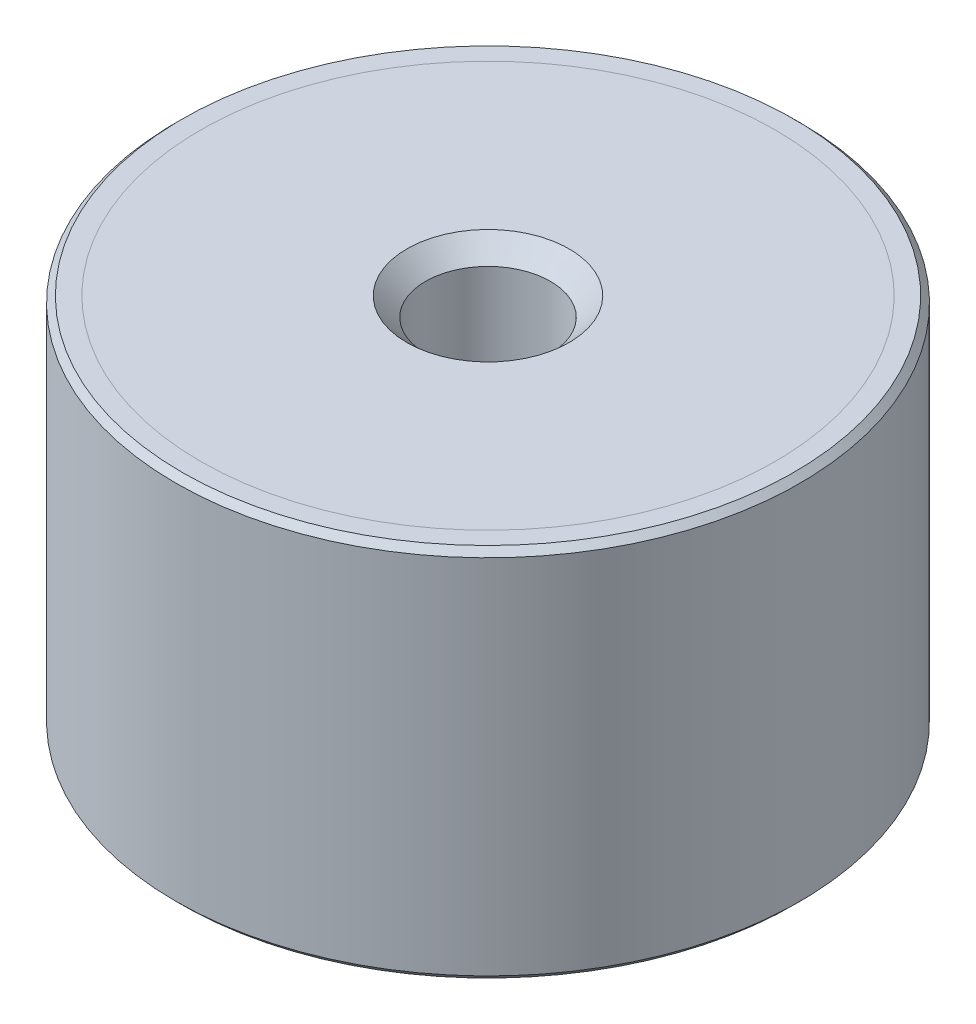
ISO-10303-21;
HEADER;
FILE_DESCRIPTION(('STEP AP214'),'2;1');
FILE_NAME('part.step','',(''),(''),'','','');
FILE_SCHEMA(('AUTOMOTIVE_DESIGN { 1 0 10303 214 1 1 1 1 }'));
ENDSEC;
DATA;
#1=APPLICATION_CONTEXT('core data for automotive mechanical design processes');
#2=APPLICATION_PROTOCOL_DEFINITION('international standard','automotive_design',2000,#1);
#3=PRODUCT_CONTEXT('',#1,'mechanical');
#4=PRODUCT('Part','Part','',(#3));
#5=PRODUCT_RELATED_PRODUCT_CATEGORY('part','',(#4));
#6=PRODUCT_DEFINITION_FORMATION('','',#4);
#7=PRODUCT_DEFINITION_CONTEXT('part definition',#1,'design');
#8=PRODUCT_DEFINITION('design','',#6,#7);
#9=PRODUCT_DEFINITION_SHAPE('','',#8);
#10=(LENGTH_UNIT() NAMED_UNIT(*) SI_UNIT(.MILLI.,.METRE.));
#11=(NAMED_UNIT(*) PLANE_ANGLE_UNIT() SI_UNIT($,.RADIAN.));
#12=(NAMED_UNIT(*) SI_UNIT($,.STERADIAN.) SOLID_ANGLE_UNIT());
#13=UNCERTAINTY_MEASURE_WITH_UNIT(LENGTH_MEASURE(1.E-05),#10,'distance_accuracy_value','');
#14=(GEOMETRIC_REPRESENTATION_CONTEXT(3) GLOBAL_UNCERTAINTY_ASSIGNED_CONTEXT((#13)) GLOBAL_UNIT_ASSIGNED_CONTEXT((#10,
#11,#12)) REPRESENTATION_CONTEXT('',''));
#15=CARTESIAN_POINT('',(0.,0.,0.));
#16=DIRECTION('',(0.,0.,1.));
#17=DIRECTION('',(1.,0.,0.));
#18=AXIS2_PLACEMENT_3D('',#15,#16,#17);
#19=CARTESIAN_POINT('',(0.,-27.,5.));
#20=DIRECTION('',(0.,1.,0.));
#21=DIRECTION('',(0.,0.,1.));
#22=AXIS2_PLACEMENT_3D('',#19,#20,#21);
#23=PLANE('',#22);
#24=CARTESIAN_POINT('',(0.,-27.,0.));
#25=DIRECTION('',(0.,1.,0.));
#26=DIRECTION('',(0.,0.,1.));
#27=AXIS2_PLACEMENT_3D('',#24,#25,#26);
#28=CIRCLE('',#27,23.);
#29=CARTESIAN_POINT('',(0.,-27.,23.));
#30=VERTEX_POINT('',#29);
#31=EDGE_CURVE('P0_E25',#30,#30,#28,.T.);
#32=ORIENTED_EDGE('',*,*,#31,.T.);
#33=EDGE_LOOP('',(#32));
#34=FACE_BOUND('',#33,.T.);
#35=CARTESIAN_POINT('',(0.,-27.,0.));
#36=DIRECTION('',(0.,1.,0.));
#37=DIRECTION('',(0.,0.,1.));
#38=AXIS2_PLACEMENT_3D('',#35,#36,#37);
#39=CIRCLE('',#38,5.);
#40=CARTESIAN_POINT('',(0.,-27.,5.));
#41=VERTEX_POINT('',#40);
#42=EDGE_CURVE('P0_E21',#41,#41,#39,.T.);
#43=ORIENTED_EDGE('',*,*,#42,.F.);
#44=EDGE_LOOP('',(#43));
#45=FACE_BOUND('',#44,.T.);
#46=ADVANCED_FACE('P0_F14',(#34,#45),#23,.T.);
#47=CARTESIAN_POINT('',(0.,41.0340428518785,0.));
#48=DIRECTION('',(0.,1.,0.));
#49=DIRECTION('',(0.,0.,1.));
#50=AXIS2_PLACEMENT_3D('',#47,#48,#49);
#51=CYLINDRICAL_SURFACE('',#50,23.);
#52=CARTESIAN_POINT('',(0.,-28.5,0.));
#53=DIRECTION('',(0.,1.,0.));
#54=DIRECTION('',(0.,0.,1.));
#55=AXIS2_PLACEMENT_3D('',#52,#53,#54);
#56=CIRCLE('',#55,23.);
#57=CARTESIAN_POINT('',(0.,-28.5,23.));
#58=VERTEX_POINT('',#57);
#59=EDGE_CURVE('P0_E29',#58,#58,#56,.T.);
#60=ORIENTED_EDGE('',*,*,#59,.T.);
#61=EDGE_LOOP('',(#60));
#62=FACE_BOUND('',#61,.T.);
#63=ORIENTED_EDGE('',*,*,#31,.F.);
#64=EDGE_LOOP('',(#63));
#65=FACE_BOUND('',#64,.T.);
#66=ADVANCED_FACE('P0_F35',(#62,#65),#51,.T.);
#67=CARTESIAN_POINT('',(0.,-28.5,23.));
#68=DIRECTION('',(0.,-1.,0.));
#69=DIRECTION('',(0.,0.,-1.));
#70=AXIS2_PLACEMENT_3D('',#67,#68,#69);
#71=PLANE('',#70);
#72=CARTESIAN_POINT('',(0.,-28.5,0.));
#73=DIRECTION('',(0.,-1.,0.));
#74=DIRECTION('',(0.,0.,-1.));
#75=AXIS2_PLACEMENT_3D('',#72,#73,#74);
#76=CIRCLE('',#75,6.5);
#77=CARTESIAN_POINT('',(0.,-28.5,-6.5));
#78=VERTEX_POINT('',#77);
#79=EDGE_CURVE('P0_E10',#78,#78,#76,.F.);
#80=ORIENTED_EDGE('',*,*,#79,.T.);
#81=EDGE_LOOP('',(#80));
#82=FACE_BOUND('',#81,.T.);
#83=ORIENTED_EDGE('',*,*,#59,.F.);
#84=EDGE_LOOP('',(#83));
#85=FACE_BOUND('',#84,.T.);
#86=ADVANCED_FACE('P0_F38',(#82,#85),#71,.T.);
#87=CARTESIAN_POINT('',(0.,-28.5,0.));
#88=DIRECTION('',(0.,-1.,0.));
#89=DIRECTION('',(0.,0.,-1.));
#90=AXIS2_PLACEMENT_3D('',#87,#88,#89);
#91=CONICAL_SURFACE('',#90,6.5,0.785398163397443);
#92=ORIENTED_EDGE('',*,*,#42,.T.);
#93=EDGE_LOOP('',(#92));
#94=FACE_BOUND('',#93,.T.);
#95=ORIENTED_EDGE('',*,*,#79,.F.);
#96=EDGE_LOOP('',(#95));
#97=FACE_BOUND('',#96,.T.);
#98=ADVANCED_FACE('P0_F16',(#94,#97),#91,.F.);
#99=CLOSED_SHELL('',(#46,#66,#86,#98));
#100=MANIFOLD_SOLID_BREP('P0_B1',#99);
#101=CARTESIAN_POINT('',(0.,1.5,5.));
#102=DIRECTION('',(0.,1.,0.));
#103=DIRECTION('',(0.,0.,1.));
#104=AXIS2_PLACEMENT_3D('',#101,#102,#103);
#105=PLANE('',#104);
#106=CARTESIAN_POINT('',(0.,1.5,0.));
#107=DIRECTION('',(0.,1.,0.));
#108=DIRECTION('',(0.,0.,1.));
#109=AXIS2_PLACEMENT_3D('',#106,#107,#108);
#110=CIRCLE('',#109,6.5);
#111=CARTESIAN_POINT('',(0.,1.5,6.5));
#112=VERTEX_POINT('',#111);
#113=EDGE_CURVE('P1_E10',#112,#112,#110,.F.);
#114=ORIENTED_EDGE('',*,*,#113,.T.);
#115=EDGE_LOOP('',(#114));
#116=FACE_BOUND('',#115,.T.);
#117=CARTESIAN_POINT('',(0.,1.5,0.));
#118=DIRECTION('',(0.,1.,0.));
#119=DIRECTION('',(0.,0.,1.));
#120=AXIS2_PLACEMENT_3D('',#117,#118,#119);
#121=CIRCLE('',#120,23.);
#122=CARTESIAN_POINT('',(0.,1.5,23.));
#123=VERTEX_POINT('',#122);
#124=EDGE_CURVE('P1_E21',#123,#123,#121,.T.);
#125=ORIENTED_EDGE('',*,*,#124,.T.);
#126=EDGE_LOOP('',(#125));
#127=FACE_BOUND('',#126,.T.);
#128=ADVANCED_FACE('P1_F14',(#116,#127),#105,.T.);
#129=CARTESIAN_POINT('',(0.,69.5340428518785,0.));
#130=DIRECTION('',(0.,1.,0.));
#131=DIRECTION('',(0.,0.,1.));
#132=AXIS2_PLACEMENT_3D('',#129,#130,#131);
#133=CYLINDRICAL_SURFACE('',#132,23.);
#134=CARTESIAN_POINT('',(0.,0.,0.));
#135=DIRECTION('',(0.,1.,0.));
#136=DIRECTION('',(0.,0.,1.));
#137=AXIS2_PLACEMENT_3D('',#134,#135,#136);
#138=CIRCLE('',#137,23.);
#139=CARTESIAN_POINT('',(0.,0.,23.));
#140=VERTEX_POINT('',#139);
#141=EDGE_CURVE('P1_E25',#140,#140,#138,.T.);
#142=ORIENTED_EDGE('',*,*,#141,.T.);
#143=EDGE_LOOP('',(#142));
#144=FACE_BOUND('',#143,.T.);
#145=ORIENTED_EDGE('',*,*,#124,.F.);
#146=EDGE_LOOP('',(#145));
#147=FACE_BOUND('',#146,.T.);
#148=ADVANCED_FACE('P1_F44',(#144,#147),#133,.T.);
#149=CARTESIAN_POINT('',(0.,0.,23.));
#150=DIRECTION('',(0.,-1.,0.));
#151=DIRECTION('',(0.,0.,-1.));
#152=AXIS2_PLACEMENT_3D('',#149,#150,#151);
#153=PLANE('',#152);
#154=CARTESIAN_POINT('',(0.,0.,0.));
#155=DIRECTION('',(0.,1.,0.));
#156=DIRECTION('',(0.,0.,1.));
#157=AXIS2_PLACEMENT_3D('',#154,#155,#156);
#158=CIRCLE('',#157,5.);
#159=CARTESIAN_POINT('',(0.,0.,5.));
#160=VERTEX_POINT('',#159);
#161=EDGE_CURVE('P1_E29',#160,#160,#158,.T.);
#162=ORIENTED_EDGE('',*,*,#161,.T.);
#163=EDGE_LOOP('',(#162));
#164=FACE_BOUND('',#163,.T.);
#165=ORIENTED_EDGE('',*,*,#141,.F.);
#166=EDGE_LOOP('',(#165));
#167=FACE_BOUND('',#166,.T.);
#168=ADVANCED_FACE('P1_F35',(#164,#167),#153,.T.);
#169=CARTESIAN_POINT('',(0.,0.,0.));
#170=DIRECTION('',(0.,1.,0.));
#171=DIRECTION('',(0.,0.,1.));
#172=AXIS2_PLACEMENT_3D('',#169,#170,#171);
#173=CONICAL_SURFACE('',#172,5.,0.78539816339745);
#174=ORIENTED_EDGE('',*,*,#113,.F.);
#175=EDGE_LOOP('',(#174));
#176=FACE_BOUND('',#175,.T.);
#177=ORIENTED_EDGE('',*,*,#161,.F.);
#178=EDGE_LOOP('',(#177));
#179=FACE_BOUND('',#178,.T.);
#180=ADVANCED_FACE('P1_F16',(#176,#179),#173,.F.);
#181=CLOSED_SHELL('',(#128,#148,#168,#180));
#182=MANIFOLD_SOLID_BREP('P1_B1',#181);
#183=CARTESIAN_POINT('',(0.,0.,0.));
#184=DIRECTION('',(0.,1.,0.));
#185=DIRECTION('',(0.,0.,1.));
#186=AXIS2_PLACEMENT_3D('',#183,#184,#185);
#187=PLANE('',#186);
#188=CARTESIAN_POINT('',(0.,0.,0.));
#189=DIRECTION('',(0.,1.,0.));
#190=DIRECTION('',(0.,0.,1.));
#191=AXIS2_PLACEMENT_3D('',#188,#189,#190);
#192=CIRCLE('',#191,5.);
#193=CARTESIAN_POINT('',(0.,0.,5.));
#194=VERTEX_POINT('',#193);
#195=EDGE_CURVE('P2_E46',#194,#194,#192,.T.);
#196=ORIENTED_EDGE('',*,*,#195,.F.);
#197=EDGE_LOOP('',(#196));
#198=FACE_BOUND('',#197,.T.);
#199=CARTESIAN_POINT('',(0.,0.,0.));
#200=DIRECTION('',(0.,1.,0.));
#201=DIRECTION('',(0.,0.,1.));
#202=AXIS2_PLACEMENT_3D('',#199,#200,#201);
#203=CIRCLE('',#202,23.);
#204=CARTESIAN_POINT('',(0.,0.,23.));
#205=VERTEX_POINT('',#204);
#206=EDGE_CURVE('P2_E33',#205,#205,#203,.T.);
#207=ORIENTED_EDGE('',*,*,#206,.T.);
#208=EDGE_LOOP('',(#207));
#209=FACE_BOUND('',#208,.T.);
#210=ADVANCED_FACE('P2_F13',(#198,#209),#187,.T.);
#211=CARTESIAN_POINT('',(0.,65.5134936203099,0.));
#212=DIRECTION('',(0.,1.,0.));
#213=DIRECTION('',(0.,0.,1.));
#214=AXIS2_PLACEMENT_3D('',#211,#212,#213);
#215=CYLINDRICAL_SURFACE('',#214,23.);
#216=CARTESIAN_POINT('',(0.,1.5,0.));
#217=DIRECTION('',(0.,1.,0.));
#218=DIRECTION('',(0.,0.,1.));
#219=AXIS2_PLACEMENT_3D('',#216,#217,#218);
#220=CIRCLE('',#219,23.);
#221=CARTESIAN_POINT('',(0.,1.5,23.));
#222=VERTEX_POINT('',#221);
#223=EDGE_CURVE('P2_E36',#222,#222,#220,.T.);
#224=ORIENTED_EDGE('',*,*,#223,.T.);
#225=EDGE_LOOP('',(#224));
#226=FACE_BOUND('',#225,.T.);
#227=ORIENTED_EDGE('',*,*,#206,.F.);
#228=EDGE_LOOP('',(#227));
#229=FACE_BOUND('',#228,.T.);
#230=ADVANCED_FACE('P2_F92',(#226,#229),#215,.F.);
#231=CARTESIAN_POINT('',(0.,1.5,23.));
#232=DIRECTION('',(0.,1.,0.));
#233=DIRECTION('',(0.,0.,1.));
#234=AXIS2_PLACEMENT_3D('',#231,#232,#233);
#235=PLANE('',#234);
#236=CARTESIAN_POINT('',(0.,1.5,0.));
#237=DIRECTION('',(0.,1.,0.));
#238=DIRECTION('',(0.,0.,1.));
#239=AXIS2_PLACEMENT_3D('',#236,#237,#238);
#240=CIRCLE('',#239,24.5);
#241=CARTESIAN_POINT('',(0.,1.5,24.5));
#242=VERTEX_POINT('',#241);
#243=EDGE_CURVE('P2_E9',#242,#242,#240,.T.);
#244=ORIENTED_EDGE('',*,*,#243,.T.);
#245=EDGE_LOOP('',(#244));
#246=FACE_BOUND('',#245,.T.);
#247=ORIENTED_EDGE('',*,*,#223,.F.);
#248=EDGE_LOOP('',(#247));
#249=FACE_BOUND('',#248,.T.);
#250=ADVANCED_FACE('P2_F88',(#246,#249),#235,.T.);
#251=CARTESIAN_POINT('',(0.,65.5134936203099,0.));
#252=DIRECTION('',(0.,1.,0.));
#253=DIRECTION('',(0.,0.,1.));
#254=AXIS2_PLACEMENT_3D('',#251,#252,#253);
#255=CYLINDRICAL_SURFACE('',#254,25.);
#256=CARTESIAN_POINT('',(0.,-28.,0.));
#257=DIRECTION('',(0.,-1.,0.));
#258=DIRECTION('',(0.,0.,-1.));
#259=AXIS2_PLACEMENT_3D('',#256,#257,#258);
#260=CIRCLE('',#259,25.);
#261=CARTESIAN_POINT('',(0.,-28.,-25.));
#262=VERTEX_POINT('',#261);
#263=EDGE_CURVE('P2_E24',#262,#262,#260,.F.);
#264=ORIENTED_EDGE('',*,*,#263,.T.);
#265=EDGE_LOOP('',(#264));
#266=FACE_BOUND('',#265,.T.);
#267=CARTESIAN_POINT('',(0.,1.00000000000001,0.));
#268=DIRECTION('',(0.,1.,0.));
#269=DIRECTION('',(0.,0.,1.));
#270=AXIS2_PLACEMENT_3D('',#267,#268,#269);
#271=CIRCLE('',#270,25.);
#272=CARTESIAN_POINT('',(0.,1.00000000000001,25.));
#273=VERTEX_POINT('',#272);
#274=EDGE_CURVE('P2_E28',#273,#273,#271,.F.);
#275=ORIENTED_EDGE('',*,*,#274,.T.);
#276=EDGE_LOOP('',(#275));
#277=FACE_BOUND('',#276,.T.);
#278=ADVANCED_FACE('P2_F82',(#266,#277),#255,.T.);
#279=CARTESIAN_POINT('',(0.,-28.5,25.));
#280=DIRECTION('',(0.,-1.,0.));
#281=DIRECTION('',(0.,0.,-1.));
#282=AXIS2_PLACEMENT_3D('',#279,#280,#281);
#283=PLANE('',#282);
#284=CARTESIAN_POINT('',(0.,-28.5,0.));
#285=DIRECTION('',(0.,-1.,0.));
#286=DIRECTION('',(0.,0.,-1.));
#287=AXIS2_PLACEMENT_3D('',#284,#285,#286);
#288=CIRCLE('',#287,24.5);
#289=CARTESIAN_POINT('',(0.,-28.5,-24.5));
#290=VERTEX_POINT('',#289);
#291=EDGE_CURVE('P2_E20',#290,#290,#288,.T.);
#292=ORIENTED_EDGE('',*,*,#291,.T.);
#293=EDGE_LOOP('',(#292));
#294=FACE_BOUND('',#293,.T.);
#295=CARTESIAN_POINT('',(0.,-28.5,0.));
#296=DIRECTION('',(0.,1.,0.));
#297=DIRECTION('',(0.,0.,1.));
#298=AXIS2_PLACEMENT_3D('',#295,#296,#297);
#299=CIRCLE('',#298,23.);
#300=CARTESIAN_POINT('',(0.,-28.5,23.));
#301=VERTEX_POINT('',#300);
#302=EDGE_CURVE('P2_E39',#301,#301,#299,.T.);
#303=ORIENTED_EDGE('',*,*,#302,.T.);
#304=EDGE_LOOP('',(#303));
#305=FACE_BOUND('',#304,.T.);
#306=ADVANCED_FACE('P2_F77',(#294,#305),#283,.T.);
#307=CARTESIAN_POINT('',(0.,65.5134936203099,0.));
#308=DIRECTION('',(0.,1.,0.));
#309=DIRECTION('',(0.,0.,1.));
#310=AXIS2_PLACEMENT_3D('',#307,#308,#309);
#311=CYLINDRICAL_SURFACE('',#310,23.);
#312=CARTESIAN_POINT('',(0.,-27.,0.));
#313=DIRECTION('',(0.,1.,0.));
#314=DIRECTION('',(0.,0.,1.));
#315=AXIS2_PLACEMENT_3D('',#312,#313,#314);
#316=CIRCLE('',#315,23.);
#317=CARTESIAN_POINT('',(0.,-27.,23.));
#318=VERTEX_POINT('',#317);
#319=EDGE_CURVE('P2_E42',#318,#318,#316,.T.);
#320=ORIENTED_EDGE('',*,*,#319,.T.);
#321=EDGE_LOOP('',(#320));
#322=FACE_BOUND('',#321,.T.);
#323=ORIENTED_EDGE('',*,*,#302,.F.);
#324=EDGE_LOOP('',(#323));
#325=FACE_BOUND('',#324,.T.);
#326=ADVANCED_FACE('P2_F71',(#322,#325),#311,.F.);
#327=CARTESIAN_POINT('',(0.,-27.,23.));
#328=DIRECTION('',(0.,-1.,0.));
#329=DIRECTION('',(0.,0.,-1.));
#330=AXIS2_PLACEMENT_3D('',#327,#328,#329);
#331=PLANE('',#330);
#332=CARTESIAN_POINT('',(0.,-27.,0.));
#333=DIRECTION('',(0.,-1.,0.));
#334=DIRECTION('',(0.,0.,-1.));
#335=AXIS2_PLACEMENT_3D('',#332,#333,#334);
#336=CIRCLE('',#335,5.);
#337=CARTESIAN_POINT('',(0.,-27.,-5.));
#338=VERTEX_POINT('',#337);
#339=EDGE_CURVE('P2_E52',#338,#338,#336,.T.);
#340=ORIENTED_EDGE('',*,*,#339,.F.);
#341=EDGE_LOOP('',(#340));
#342=FACE_BOUND('',#341,.T.);
#343=ORIENTED_EDGE('',*,*,#319,.F.);
#344=EDGE_LOOP('',(#343));
#345=FACE_BOUND('',#344,.T.);
#346=ADVANCED_FACE('P2_F67',(#342,#345),#331,.T.);
#347=CARTESIAN_POINT('',(0.,-28.,0.));
#348=DIRECTION('',(0.,1.,0.));
#349=DIRECTION('',(0.,0.,1.));
#350=AXIS2_PLACEMENT_3D('',#347,#348,#349);
#351=CONICAL_SURFACE('',#350,25.,0.785398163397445);
#352=ORIENTED_EDGE('',*,*,#291,.F.);
#353=EDGE_LOOP('',(#352));
#354=FACE_BOUND('',#353,.T.);
#355=ORIENTED_EDGE('',*,*,#263,.F.);
#356=EDGE_LOOP('',(#355));
#357=FACE_BOUND('',#356,.T.);
#358=ADVANCED_FACE('P2_F70',(#354,#357),#351,.T.);
#359=CARTESIAN_POINT('',(0.,1.5,0.));
#360=DIRECTION('',(0.,-1.,0.));
#361=DIRECTION('',(0.,0.,-1.));
#362=AXIS2_PLACEMENT_3D('',#359,#360,#361);
#363=CONICAL_SURFACE('',#362,24.5,0.785398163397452);
#364=ORIENTED_EDGE('',*,*,#274,.F.);
#365=EDGE_LOOP('',(#364));
#366=FACE_BOUND('',#365,.T.);
#367=ORIENTED_EDGE('',*,*,#243,.F.);
#368=EDGE_LOOP('',(#367));
#369=FACE_BOUND('',#368,.T.);
#370=ADVANCED_FACE('P2_F15',(#366,#369),#363,.T.);
#371=CARTESIAN_POINT('',(0.,-8.5,0.));
#372=DIRECTION('',(0.,1.,0.));
#373=DIRECTION('',(0.,0.,1.));
#374=AXIS2_PLACEMENT_3D('',#371,#372,#373);
#375=CYLINDRICAL_SURFACE('',#374,5.);
#376=CARTESIAN_POINT('',(0.,-8.5,0.));
#377=DIRECTION('',(0.,1.,0.));
#378=DIRECTION('',(0.,0.,1.));
#379=AXIS2_PLACEMENT_3D('',#376,#377,#378);
#380=CIRCLE('',#379,5.);
#381=CARTESIAN_POINT('',(0.,-8.5,5.));
#382=VERTEX_POINT('',#381);
#383=EDGE_CURVE('P2_E45',#382,#382,#380,.T.);
#384=ORIENTED_EDGE('',*,*,#383,.F.);
#385=EDGE_LOOP('',(#384));
#386=FACE_BOUND('',#385,.T.);
#387=ORIENTED_EDGE('',*,*,#195,.T.);
#388=EDGE_LOOP('',(#387));
#389=FACE_BOUND('',#388,.T.);
#390=ADVANCED_FACE('P2_F108',(#386,#389),#375,.F.);
#391=CARTESIAN_POINT('',(0.,-8.5,0.));
#392=DIRECTION('',(0.,1.,0.));
#393=DIRECTION('',(0.,0.,1.));
#394=AXIS2_PLACEMENT_3D('',#391,#392,#393);
#395=PLANE('',#394);
#396=ORIENTED_EDGE('',*,*,#383,.T.);
#397=EDGE_LOOP('',(#396));
#398=FACE_BOUND('',#397,.T.);
#399=ADVANCED_FACE('P2_F63',(#398),#395,.T.);
#400=CARTESIAN_POINT('',(0.,-18.5,0.));
#401=DIRECTION('',(0.,-1.,0.));
#402=DIRECTION('',(0.,0.,-1.));
#403=AXIS2_PLACEMENT_3D('',#400,#401,#402);
#404=CYLINDRICAL_SURFACE('',#403,5.);
#405=CARTESIAN_POINT('',(0.,-18.5,0.));
#406=DIRECTION('',(0.,-1.,0.));
#407=DIRECTION('',(0.,0.,-1.));
#408=AXIS2_PLACEMENT_3D('',#405,#406,#407);
#409=CIRCLE('',#408,5.);
#410=CARTESIAN_POINT('',(0.,-18.5,-5.));
#411=VERTEX_POINT('',#410);
#412=EDGE_CURVE('P2_E49',#411,#411,#409,.T.);
#413=ORIENTED_EDGE('',*,*,#412,.F.);
#414=EDGE_LOOP('',(#413));
#415=FACE_BOUND('',#414,.T.);
#416=ORIENTED_EDGE('',*,*,#339,.T.);
#417=EDGE_LOOP('',(#416));
#418=FACE_BOUND('',#417,.T.);
#419=ADVANCED_FACE('P2_F60',(#415,#418),#404,.F.);
#420=CARTESIAN_POINT('',(0.,-18.5,0.));
#421=DIRECTION('',(0.,-1.,0.));
#422=DIRECTION('',(0.,0.,-1.));
#423=AXIS2_PLACEMENT_3D('',#420,#421,#422);
#424=PLANE('',#423);
#425=ORIENTED_EDGE('',*,*,#412,.T.);
#426=EDGE_LOOP('',(#425));
#427=FACE_BOUND('',#426,.T.);
#428=ADVANCED_FACE('P2_F58',(#427),#424,.T.);
#429=CLOSED_SHELL('',(#210,#230,#250,#278,#306,#326,#346,#358,#370,#390,#399,#419,#428));
#430=MANIFOLD_SOLID_BREP('P2_B1',#429);
#431=ADVANCED_BREP_SHAPE_REPRESENTATION('',(#18,#100,#182,#430),#14);
#432=SHAPE_DEFINITION_REPRESENTATION(#9,#431);
ENDSEC;
END-ISO-10303-21;
